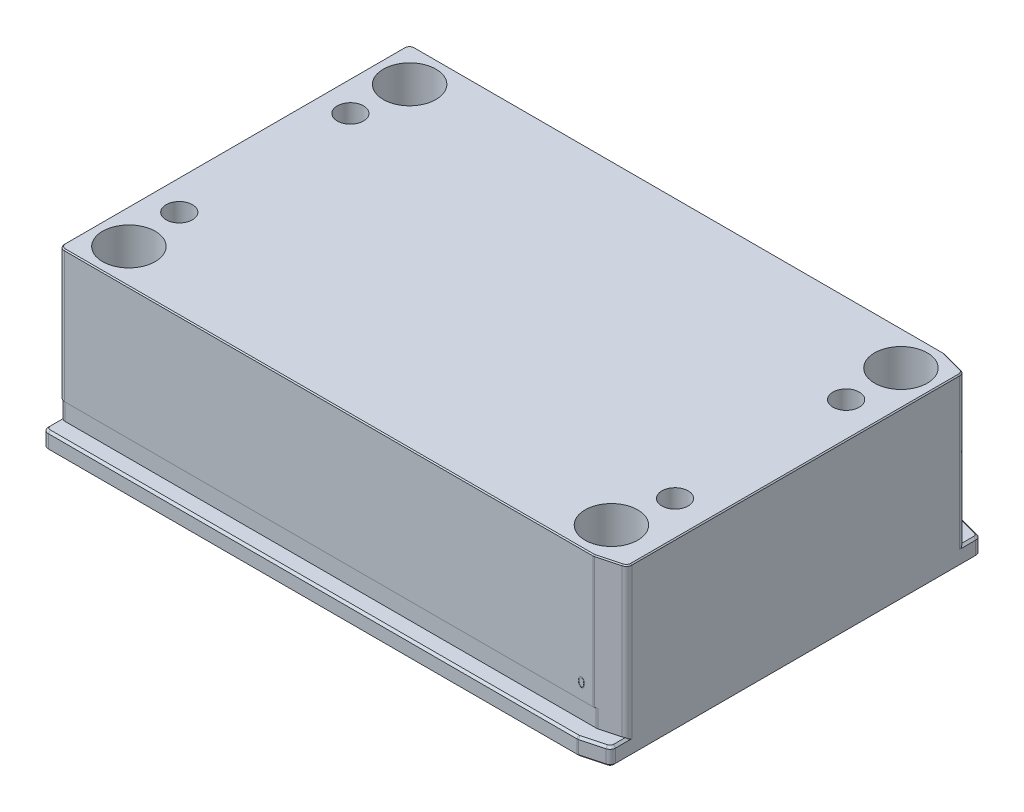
from build123d import *
from OCP.BRepFilletAPI import BRepFilletAPI_MakeChamfer

# Parameters (mm, degrees)
SKETCH1_W                   = 203.2
SKETCH1_H                   = 138.5824
BOSS_EXTRUDE1_DEPTH         = 60.325
SKETCH2_W                   = 5.842
SKETCH2_H                   = 54.0004
CUT_EXTRUDE1_DEPTH          = 224.003623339
HOLE1_D                     = 19.06778
HOLE1_CBORE_D               = 22.098
HOLE1_CBORE_DEPTH           = 7.3152
SKETCH5_W                   = 11.684
SKETCH5_H                   = 1.1684
HOLE2_AT_2_COUNT            = 2
HOLE2_AT_2_PITCH            = 101.6
HOLE2_AT_3_COUNT            = 2
HOLE2_AT_3_PITCH            = 204.781346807
HOLE2_AT_4_COUNT            = 2
HOLE2_AT_4_PITCH            = 174.625
CHAMFER1_SIZE               = 9.652
CHAMFER1_SIZE2              = 2.586245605
SKETCH14_W                  = 0.254
SKETCH14_H                  = 6.35
CUT_EXTRUDE2_DEPTH          = 224.003623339
F_1_4_20_TAPPED_HOLE1_D     = 5.1054
F_1_4_20_TAPPED_HOLE1_DEPTH = 11.938
F_1_4_20_TAPPED_HOLE1_TIP   = 1.533816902
HOLE3_D                     = 9.525
HOLE4_D                     = 12.7254
HOLE4_DEPTH                 = 5.1562
F_3_8_16_TAPPED_HOLE1_D     = 7.9375
F_3_8_16_TAPPED_HOLE1_DEPTH = 20.9042
F_3_8_16_TAPPED_HOLE1_TIP   = 2.384665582
FILLET1_R                   = 2.032
FILLET2_R                   = 2.032
CHAMFER5_SIZE               = 0.762
CHAMFER2_SIZE               = 0.381
CHAMFER3_SIZE               = 0.762
CHAMFER4_SIZE               = 0.381
CUT_EXTRUDE3_DEPTH          = 0.0508


with BuildPart() as part:
    # Sketch1 → Boss-Extrude1 (new body)
    with BuildSketch(Plane(origin=(0, 0, 0), x_dir=(1, 0, 0), z_dir=(0, 1, 0))):
        Rectangle(SKETCH1_W, SKETCH1_H)
    extrude(amount=BOSS_EXTRUDE1_DEPTH)

    # Sketch2 → Cut-Extrude1 (cut, through all)
    with BuildSketch(Plane(origin=(101.6, 0, 0), x_dir=(0, 0, -1), z_dir=(1, 0, 0))):
        with Locations((-66.3702, 33.3248)):
            Rectangle(SKETCH2_W, SKETCH2_H)
        with Locations((66.3702, 33.3248)):
            Rectangle(SKETCH2_W, SKETCH2_H)
    extrude(amount=-CUT_EXTRUDE1_DEPTH, mode=Mode.SUBTRACT)

    # Hole1 (through all)
    with Locations(Plane(origin=(0, 0, 0), x_dir=(-1, 0, 0), z_dir=(0, -1, 0))):
        with Locations((88.9, -50.8), (-85.725, -50.8), (-88.9, 50.8), (88.9, 50.8)):
            CounterBoreHole(HOLE1_D / 2, HOLE1_CBORE_D / 2, HOLE1_CBORE_DEPTH)

    # Sketch5 → Hole2 (revolve, cut)
    with BuildSketch(Plane(origin=(-88.9, 2.54, 50.8), x_dir=(0, 0, 1), z_dir=(1, 0, 0))):
        with Locations((5.842, 0.5842)):
            Rectangle(SKETCH5_W, SKETCH5_H)
    hole2 = revolve(axis=Axis((-88.9, -107.46, 50.8), (0, 1, 0)), mode=Mode.SUBTRACT)

    # Hole2 at 2: Hole2 ×2
    with Locations(*[(0, 0, -i * HOLE2_AT_2_PITCH) for i in range(1, HOLE2_AT_2_COUNT)]):
        add(hole2, mode=Mode.SUBTRACT)

    # Hole2 at 3: Hole2 ×2
    with Locations(*[Vector(0.8682431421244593, 0, -0.4961389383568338) * (i * HOLE2_AT_3_PITCH) for i in range(1, HOLE2_AT_3_COUNT)]):
        add(hole2, mode=Mode.SUBTRACT)

    # Hole2 at 4: Hole2 ×2
    with Locations(*[(i * HOLE2_AT_4_PITCH, 0, 0) for i in range(1, HOLE2_AT_4_COUNT)]):
        add(hole2, mode=Mode.SUBTRACT)

    # Chamfer1: one chamfer whose edges measure the first distance from different faces: ONE call of the kernel's chamfer builder (chamfer() names one face for all edges)
    chamfer1_edges_1 = [part.edges().sort_by_distance(p)[0] for p in [
        (101.6, 3.1623, 69.2912),
    ]]
    chamfer1_side_1 = [part.faces().sort_by_distance(p)[0] for p in [
        (0, 3.1623, 69.2912),
    ]]
    chamfer1_edges_2 = [part.edges().sort_by_distance(p)[0] for p in [
        (101.6, 33.3248, 63.4492),
    ]]
    chamfer1_side_2 = [part.faces().sort_by_distance(p)[0] for p in [
        (0, 33.3248, 63.4492),
    ]]
    chamfer1_edges_3 = [part.edges().sort_by_distance(p)[0] for p in [
        (101.6, 3.1623, -69.2912),
    ]]
    chamfer1_side_3 = [part.faces().sort_by_distance(p)[0] for p in [
        (0, 3.1623, -69.2912),
    ]]
    chamfer1_edges_4 = [part.edges().sort_by_distance(p)[0] for p in [
        (101.6, 33.3248, -63.4492),
    ]]
    chamfer1_side_4 = [part.faces().sort_by_distance(p)[0] for p in [
        (0, 33.3248, -63.4492),
    ]]
    chamfer1 = BRepFilletAPI_MakeChamfer(part.part.solid().wrapped)
    for e in chamfer1_edges_1:
        chamfer1.Add(CHAMFER1_SIZE, CHAMFER1_SIZE2, e.wrapped, chamfer1_side_1[0].wrapped)  # the first distance lies on this face
    for e in chamfer1_edges_2:
        chamfer1.Add(CHAMFER1_SIZE, CHAMFER1_SIZE2, e.wrapped, chamfer1_side_2[0].wrapped)  # the first distance lies on this face
    for e in chamfer1_edges_3:
        chamfer1.Add(CHAMFER1_SIZE, CHAMFER1_SIZE2, e.wrapped, chamfer1_side_3[0].wrapped)  # the first distance lies on this face
    for e in chamfer1_edges_4:
        chamfer1.Add(CHAMFER1_SIZE, CHAMFER1_SIZE2, e.wrapped, chamfer1_side_4[0].wrapped)  # the first distance lies on this face
    add(Compound.cast(chamfer1.Shape()), mode=Mode.REPLACE)

    # Sketch14 → Cut-Extrude2 (cut, through all)
    with BuildSketch(Plane(origin=(101.6, 0, 0), x_dir=(0, 0, -1), z_dir=(1, 0, 0))):
        with Locations((-63.3222, 9.4996)):
            Rectangle(SKETCH14_W, SKETCH14_H)
        with Locations((63.3222, 9.4996)):
            Rectangle(SKETCH14_W, SKETCH14_H)
    extrude(amount=-CUT_EXTRUDE2_DEPTH, mode=Mode.SUBTRACT)

    # 1_4-20 Tapped Hole1
    with Locations(Plane.ZY.offset(101.6)):
        with Locations((0, 10.16)):
            Hole(F_1_4_20_TAPPED_HOLE1_D / 2, depth=F_1_4_20_TAPPED_HOLE1_DEPTH)
            with Locations((0, 0, -(F_1_4_20_TAPPED_HOLE1_DEPTH + F_1_4_20_TAPPED_HOLE1_TIP / 2))):  # 118° drill point
                Cone(0, F_1_4_20_TAPPED_HOLE1_D / 2, F_1_4_20_TAPPED_HOLE1_TIP, mode=Mode.SUBTRACT)

    # Hole3 (through all)
    with Locations(Plane(origin=(0, 60.325, 0), x_dir=(1, 0, 0), z_dir=(0, 1, 0))):
        with Locations((-90.5002, -30.9626), (-90.5002, 30.9626), (88.9, 30.9626), (88.9, -30.9626)):
            Hole(HOLE3_D / 2)

    # Hole4
    with Locations(Plane(origin=(0, 0, 0), x_dir=(-1, 0, 0), z_dir=(0, -1, 0))):
        with Locations((85.725, 0), (-76.2, 0)):
            Hole(HOLE4_D / 2, depth=HOLE4_DEPTH)

    # 3_8-16 Tapped Hole1
    with Locations(Plane(origin=(0, 5.1562, 0), x_dir=(-1, 0, 0), z_dir=(0, -1, 0))):
        with Locations((-76.2, 0), (85.725, 0)):
            Hole(F_3_8_16_TAPPED_HOLE1_D / 2, depth=F_3_8_16_TAPPED_HOLE1_DEPTH)
            with Locations((0, 0, -(F_3_8_16_TAPPED_HOLE1_DEPTH + F_3_8_16_TAPPED_HOLE1_TIP / 2))):  # 118° drill point
                Cone(0, F_3_8_16_TAPPED_HOLE1_D / 2, F_3_8_16_TAPPED_HOLE1_TIP, mode=Mode.SUBTRACT)

    # Fillet1
    fillet1_edges = [part.edges().sort_by_distance(p)[0] for p in [
        (101.6, 3.1623, 66.704954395),
        (101.6, 33.3248, 60.862954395),
        (101.6, 33.3248, -60.862954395),
        (101.6, 3.1623, -66.704954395),
        (91.948, 3.1623, 69.2912),
        (92.895940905, 9.4996, 63.1952),
        (-101.6, 9.4996, 63.1952),
        (92.895940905, 9.4996, -63.1952),
        (-101.6, 9.4996, -63.1952),
        (-101.6, 3.1623, 69.2912),
        (-101.6, 3.1623, -69.2912),
        (91.948, 3.1623, -69.2912),
    ]]
    fillet(fillet1_edges, radius=FILLET1_R)

    # Fillet2
    fillet2_edges = [part.edges().sort_by_distance(p)[0] for p in [
        (91.948, 36.4998, -63.4492),
        (91.948, 36.4998, 63.4492),
        (-101.6, 36.4998, 63.4492),
        (-101.6, 36.4998, -63.4492),
    ]]
    fillet(fillet2_edges, radius=FILLET2_R)

    # Chamfer5
    chamfer5_edges = [part.edges().sort_by_distance(p)[0] for p in [
        (-101.6, 10.16, 2.5527),
    ]]
    chamfer(chamfer5_edges, length=CHAMFER5_SIZE)

    # Chamfer2
    chamfer2_edges = [part.edges().sort_by_distance(p)[0] for p in [
        (96.150161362, 60.325, -62.323234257),
        (101.6, 60.325, 0),
        (101.180093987, 60.325, 60.540749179),
        (101.180093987, 60.325, -60.540749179),
        (-101.6, 60.325, 0),
        (-3.943758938, 60.325, -63.4492),
        (-3.943758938, 60.325, 63.4492),
        (96.150161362, 60.325, 62.323234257),
        (-101.004840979, 60.325, 62.854040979),
        (91.945711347, 60.325, 63.431815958),
        (91.945711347, 60.325, -63.431815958),
        (-101.004840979, 60.325, -62.854040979),
    ]]
    chamfer(chamfer2_edges, length=CHAMFER2_SIZE)

    # Chamfer3
    chamfer3_edges = [part.edges().sort_by_distance(p)[0] for p in [
        (-3.943758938, 0, 69.2912),
        (-3.943758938, 6.3246, 69.2912),
        (-3.943758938, 0, -69.2912),
        (96.150161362, 0, -68.165234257),
        (101.6, 0, 0),
        (96.150161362, 0, 68.165234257),
        (-101.6, 0, 0),
        (91.945711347, 0, 69.273815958),
        (101.180093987, 0, 66.382749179),
        (101.180093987, 0, -66.382749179),
        (91.945711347, 0, -69.273815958),
        (-101.004840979, 0, -68.696040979),
        (-101.004840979, 0, 68.696040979),
        (-101.6, 6.3246, 64.2112),
        (96.150161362, 6.3246, 68.165234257),
        (101.6, 6.3246, 62.224745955),
        (91.945711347, 6.3246, 69.273815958),
        (101.180093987, 6.3246, 66.382749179),
        (-101.004840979, 6.3246, 68.696040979),
        (-3.943758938, 6.3246, -69.2912),
        (96.150161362, 6.3246, -68.165234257),
        (101.180093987, 6.3246, -66.382749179),
        (91.945711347, 6.3246, -69.273815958),
        (-101.004840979, 6.3246, -68.696040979),
        (-101.6, 6.3246, -64.2112),
        (101.6, 6.3246, -62.224745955),
    ]]
    chamfer(chamfer3_edges, length=CHAMFER3_SIZE)

    # Chamfer4
    chamfer4_edges = [part.edges().sort_by_distance(p)[0] for p in [
        (-98.43389, 7.3152, -50.8),
        (79.36611, 7.3152, -50.8),
        (76.19111, 7.3152, 50.8),
        (-98.43389, 7.3152, 50.8),
    ]]
    chamfer(chamfer4_edges, length=CHAMFER4_SIZE)

    # Sketch23 → Cut-Extrude3 (cut)
    with BuildSketch(Plane.XY.offset(63.4492)):
        with BuildLine():
            add(Edge.make_bspline(
                [(86.489412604, 18.316015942), (86.489710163, 18.366904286), (86.490288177, 18.465755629), (86.496718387, 18.609795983), (86.507400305, 18.744924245), (86.522039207, 18.871146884), (86.539853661, 18.988496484), (86.563634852, 19.096659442), (86.590679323, 19.196136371), (86.622023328, 19.287251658), (86.657390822, 19.37123286), (86.695884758, 19.449632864), (86.739032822, 19.522333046), (86.784369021, 19.590493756), (86.833728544, 19.65299925), (86.885706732, 19.710732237), (86.942332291, 19.762358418), (87.001680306, 19.809390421), (87.064288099, 19.850619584), (87.128371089, 19.886934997), (87.194370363, 19.917959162), (87.262466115, 19.942352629), (87.332046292, 19.96250104), (87.403354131, 19.976279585), (87.476507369, 19.984949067), (87.525884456, 19.985777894), (87.550926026, 19.986198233)],
                knots=[0, 0, 0, 0, 1.646270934, 3.197905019, 4.663502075, 6.030701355, 7.308322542, 8.50163776, 9.611534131, 10.641858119, 11.616356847, 12.558055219, 13.465016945, 14.349605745, 15.204443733, 16.039544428, 16.859896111, 17.680448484, 18.487036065, 19.28249412, 20.06191084, 20.843045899, 21.620316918, 22.403196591, 23.190181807, 24, 24, 24, 24], degree=3))
            add(Edge.make_bspline(
                [(87.550926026, 19.986198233), (87.576176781, 19.985755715), (87.626392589, 19.984875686), (87.700633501, 19.976417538), (87.773159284, 19.962383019), (87.843660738, 19.942497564), (87.912716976, 19.9178272), (87.97978786, 19.886905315), (88.045289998, 19.850910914), (88.108182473, 19.808616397), (88.169155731, 19.761461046), (88.226712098, 19.708154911), (88.280856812, 19.649236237), (88.33226941, 19.585335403), (88.379491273, 19.515226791), (88.424461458, 19.440129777), (88.464713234, 19.358731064), (88.503479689, 19.272388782), (88.536941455, 19.178713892), (88.567118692, 19.07823443), (88.591501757, 18.969763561), (88.611812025, 18.853870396), (88.627546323, 18.730129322), (88.639005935, 18.598805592), (88.645059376, 18.45981281), (88.646199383, 18.364782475), (88.646784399, 18.316015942)],
                knots=[0, 0, 0, 0, 0.810914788, 1.612654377, 2.396697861, 3.181598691, 3.963628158, 4.749916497, 5.551656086, 6.361998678, 7.18212741, 8.025565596, 8.878627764, 9.750805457, 10.657531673, 11.591944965, 12.560506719, 13.57287815, 14.630710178, 15.753379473, 16.941251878, 18.199788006, 19.531962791, 20.947069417, 22.433333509, 24, 24, 24, 24], degree=3))
            add(Edge.make_bspline(
                [(88.646784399, 18.316015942), (88.646193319, 18.267462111), (88.645041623, 18.172856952), (88.639073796, 18.034489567), (88.627318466, 17.90386277), (88.612613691, 17.78066328), (88.59224746, 17.665403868), (88.567205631, 17.55768569), (88.53940141, 17.457043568), (88.505079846, 17.364301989), (88.467514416, 17.278167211), (88.426642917, 17.197733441), (88.382855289, 17.122289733), (88.335149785, 17.052439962), (88.284301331, 16.987689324), (88.229221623, 16.929180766), (88.171463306, 16.875504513), (88.110310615, 16.827741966), (88.046437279, 16.785936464), (87.981160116, 16.748549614), (87.913320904, 16.718402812), (87.844457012, 16.692517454), (87.773583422, 16.67274133), (87.700788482, 16.659067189), (87.626442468, 16.649477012), (87.576185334, 16.64874542), (87.550926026, 16.64837772)],
                knots=[0, 0, 0, 0, 1.561518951, 3.042555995, 4.452378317, 5.7783523, 7.031515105, 8.214008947, 9.334062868, 10.386615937, 11.391082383, 12.354592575, 13.286541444, 14.194233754, 15.072674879, 15.931287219, 16.775624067, 17.606195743, 18.42308326, 19.229000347, 20.022332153, 20.807536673, 21.593273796, 22.3848459, 23.188221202, 24, 24, 24, 24], degree=3))
            add(Edge.make_bspline(
                [(87.550926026, 16.64837772), (87.525885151, 16.648800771), (87.476509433, 16.649634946), (87.403346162, 16.658265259), (87.332332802, 16.672140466), (87.263118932, 16.691568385), (87.195349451, 16.715348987), (87.129947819, 16.746331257), (87.066186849, 16.782012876), (87.004236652, 16.822648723), (86.945261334, 16.869204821), (86.888929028, 16.92069814), (86.836654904, 16.978413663), (86.788001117, 17.041440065), (86.741760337, 17.109197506), (86.699224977, 17.182611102), (86.659881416, 17.261389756), (86.623919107, 17.346042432), (86.592034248, 17.437804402), (86.563869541, 17.537725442), (86.541631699, 17.646687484), (86.52259716, 17.763815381), (86.507244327, 17.889612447), (86.496762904, 18.024146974), (86.490284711, 18.167335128), (86.489708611, 18.26555128), (86.489412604, 18.316015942)],
                knots=[0, 0, 0, 0, 0.810891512, 1.598919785, 2.382837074, 3.152667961, 3.926044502, 4.706494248, 5.493654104, 6.291793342, 7.103789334, 7.925228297, 8.761435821, 9.622817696, 10.50288917, 11.416980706, 12.369136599, 13.353924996, 14.394355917, 15.514179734, 16.714354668, 17.994756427, 19.357759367, 20.818452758, 22.365282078, 24, 24, 24, 24], degree=3))
        make_face()
        with BuildLine():
            add(Edge.make_bspline(
                [(86.774348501, 18.317287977), (86.774456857, 18.274880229), (86.774667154, 18.192575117), (86.780160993, 18.072974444), (86.787645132, 17.961422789), (86.797298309, 17.857778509), (86.811633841, 17.762392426), (86.827696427, 17.6746085), (86.847243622, 17.594891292), (86.870371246, 17.522693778), (86.896713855, 17.456790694), (86.925475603, 17.395466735), (86.956373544, 17.337997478), (86.990953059, 17.284899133), (87.028613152, 17.235998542), (87.06850318, 17.190430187), (87.112111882, 17.149792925), (87.172440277, 17.101054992), (87.252084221, 17.050691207), (87.352432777, 17.006834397), (87.455546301, 16.979273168), (87.525533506, 16.97576819), (87.56046629, 16.974018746)],
                knots=[0, 0, 0, 0, 1.459021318, 2.831673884, 4.118529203, 5.306027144, 6.411944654, 7.436330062, 8.375795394, 9.233974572, 10.042671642, 10.816086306, 11.563610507, 12.285937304, 12.993564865, 13.685989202, 14.367179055, 15.041617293, 16.353048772, 17.594441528, 18.799311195, 20, 20, 20, 20], degree=3))
            add(Edge.make_bspline(
                [(87.56046629, 16.974018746), (87.595625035, 16.975468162), (87.665869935, 16.978364), (87.768498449, 17.006302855), (87.868130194, 17.048457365), (87.94620974, 17.098302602), (88.005611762, 17.145771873), (88.048172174, 17.186243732), (88.087235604, 17.23156084), (88.1242852, 17.280455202), (88.158265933, 17.333860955), (88.189166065, 17.391521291), (88.217363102, 17.453596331), (88.233427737, 17.496930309), (88.24164117, 17.519085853)],
                knots=[0, 0, 0, 0, 1.353760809, 2.704726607, 4.075137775, 5.516104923, 6.260822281, 7.007110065, 7.778089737, 8.566572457, 9.372053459, 10.217411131, 11.088608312, 12, 12, 12, 12], degree=3))
            add(Edge.make_bspline(
                [(88.24164117, 17.519085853), (88.251213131, 17.547415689), (88.270648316, 17.604937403), (88.29569614, 17.694167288), (88.315422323, 17.787786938), (88.333169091, 17.885236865), (88.34528222, 17.987235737), (88.355032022, 18.093467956), (88.36077486, 18.204013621), (88.361486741, 18.279120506), (88.361848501, 18.317287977)],
                knots=[0, 0, 0, 0, 0.884706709, 1.796334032, 2.740027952, 3.714592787, 4.726048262, 5.777819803, 6.87074269, 8, 8, 8, 8], degree=3))
            add(Edge.make_bspline(
                [(88.361848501, 18.317287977), (88.361349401, 18.355449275), (88.360373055, 18.430100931), (88.35664108, 18.539428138), (88.34700398, 18.64326675), (88.336300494, 18.742064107), (88.320518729, 18.83527331), (88.303502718, 18.923674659), (88.280641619, 19.006172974), (88.256221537, 19.08405988), (88.228272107, 19.156450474), (88.197505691, 19.223682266), (88.164647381, 19.286079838), (88.128958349, 19.343471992), (88.090862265, 19.396115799), (88.049353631, 19.442955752), (88.00607895, 19.485443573), (87.945466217, 19.533941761), (87.86611454, 19.583391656), (87.767375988, 19.628899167), (87.664623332, 19.655032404), (87.59516027, 19.658716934), (87.56046629, 19.660557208)],
                knots=[0, 0, 0, 0, 1.31362396, 2.569729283, 3.763502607, 4.902122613, 5.988968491, 7.01645872, 7.998833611, 8.933434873, 9.825090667, 10.667526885, 11.477055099, 12.250526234, 12.991942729, 13.710640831, 14.402115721, 15.076753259, 16.378508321, 17.609869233, 18.806226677, 20, 20, 20, 20], degree=3))
            add(Edge.make_bspline(
                [(87.56046629, 19.660557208), (87.525350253, 19.658714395), (87.455054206, 19.655025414), (87.351233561, 19.628996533), (87.251716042, 19.583627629), (87.172574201, 19.533777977), (87.111919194, 19.486299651), (87.069208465, 19.445127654), (87.029161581, 19.400091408), (86.992270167, 19.3507411), (86.957717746, 19.29770466), (86.92598497, 19.240564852), (86.897394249, 19.179032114), (86.87101042, 19.113158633), (86.847812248, 19.040967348), (86.82867701, 18.961348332), (86.810999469, 18.873843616), (86.798485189, 18.77794092), (86.787360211, 18.674270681), (86.780210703, 18.562440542), (86.774648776, 18.442639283), (86.774450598, 18.359908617), (86.774348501, 18.317287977)],
                knots=[0, 0, 0, 0, 1.207732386, 2.417664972, 3.655092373, 4.956220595, 5.625982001, 6.301752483, 6.994047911, 7.697131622, 8.419323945, 9.170223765, 9.943494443, 10.752040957, 11.610060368, 12.549350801, 13.567764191, 14.679664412, 15.874934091, 17.154273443, 18.533957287, 20, 20, 20, 20], degree=3))
        make_face(mode=Mode.SUBTRACT)
    extrude(amount=-CUT_EXTRUDE3_DEPTH, mode=Mode.SUBTRACT)


solid = part.part
